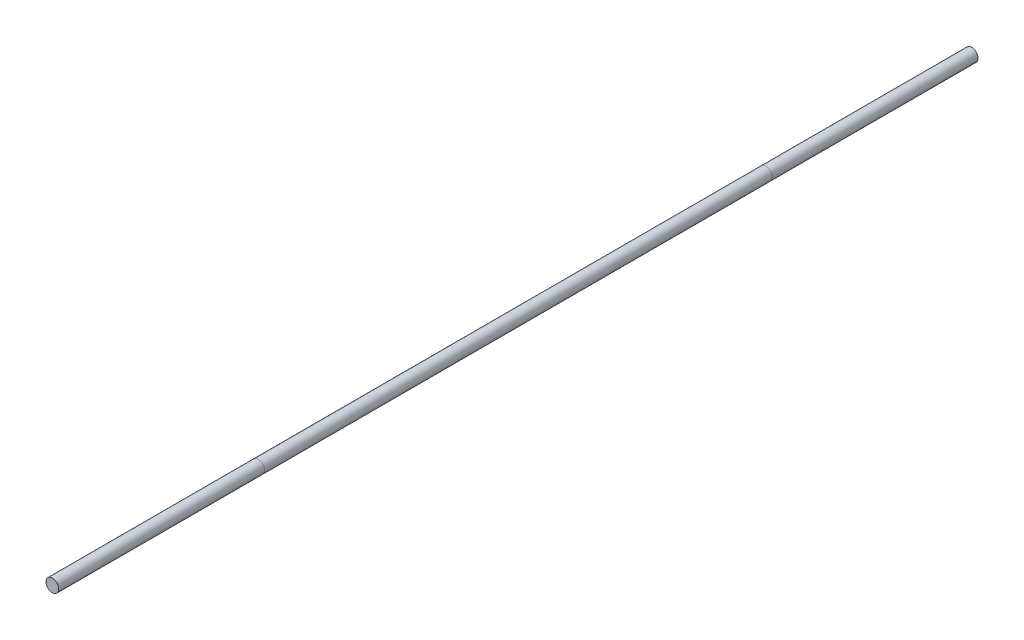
ISO-10303-21;
HEADER;
FILE_DESCRIPTION(('STEP AP214'),'2;1');
FILE_NAME('part.step','',(''),(''),'','','');
FILE_SCHEMA(('AUTOMOTIVE_DESIGN { 1 0 10303 214 1 1 1 1 }'));
ENDSEC;
DATA;
#1=APPLICATION_CONTEXT('core data for automotive mechanical design processes');
#2=APPLICATION_PROTOCOL_DEFINITION('international standard','automotive_design',2000,#1);
#3=PRODUCT_CONTEXT('',#1,'mechanical');
#4=PRODUCT('Part','Part','',(#3));
#5=PRODUCT_RELATED_PRODUCT_CATEGORY('part','',(#4));
#6=PRODUCT_DEFINITION_FORMATION('','',#4);
#7=PRODUCT_DEFINITION_CONTEXT('part definition',#1,'design');
#8=PRODUCT_DEFINITION('design','',#6,#7);
#9=PRODUCT_DEFINITION_SHAPE('','',#8);
#10=(LENGTH_UNIT() NAMED_UNIT(*) SI_UNIT(.MILLI.,.METRE.));
#11=(NAMED_UNIT(*) PLANE_ANGLE_UNIT() SI_UNIT($,.RADIAN.));
#12=(NAMED_UNIT(*) SI_UNIT($,.STERADIAN.) SOLID_ANGLE_UNIT());
#13=UNCERTAINTY_MEASURE_WITH_UNIT(LENGTH_MEASURE(1.E-05),#10,'distance_accuracy_value','');
#14=(GEOMETRIC_REPRESENTATION_CONTEXT(3) GLOBAL_UNCERTAINTY_ASSIGNED_CONTEXT((#13)) GLOBAL_UNIT_ASSIGNED_CONTEXT((#10,
#11,#12)) REPRESENTATION_CONTEXT('',''));
#15=CARTESIAN_POINT('',(0.,0.,0.));
#16=DIRECTION('',(0.,0.,1.));
#17=DIRECTION('',(1.,0.,0.));
#18=AXIS2_PLACEMENT_3D('',#15,#16,#17);
#19=CARTESIAN_POINT('',(0.,0.,230.));
#20=DIRECTION('',(0.,0.,-1.));
#21=DIRECTION('',(-1.,0.,0.));
#22=AXIS2_PLACEMENT_3D('',#19,#20,#21);
#23=CYLINDRICAL_SURFACE('',#22,3.175);
#24=CARTESIAN_POINT('',(0.,0.,127.));
#25=DIRECTION('',(0.,0.,1.));
#26=DIRECTION('',(1.,0.,0.));
#27=AXIS2_PLACEMENT_3D('',#24,#25,#26);
#28=CIRCLE('',#27,3.175);
#29=CARTESIAN_POINT('',(3.175,0.,127.));
#30=VERTEX_POINT('',#29);
#31=EDGE_CURVE('E42',#30,#30,#28,.T.);
#32=ORIENTED_EDGE('',*,*,#31,.F.);
#33=EDGE_LOOP('',(#32));
#34=FACE_BOUND('',#33,.T.);
#35=CARTESIAN_POINT('',(0.,0.,-127.));
#36=DIRECTION('',(0.,0.,1.));
#37=DIRECTION('',(1.,0.,0.));
#38=AXIS2_PLACEMENT_3D('',#35,#36,#37);
#39=CIRCLE('',#38,3.175);
#40=CARTESIAN_POINT('',(3.175,0.,-127.));
#41=VERTEX_POINT('',#40);
#42=EDGE_CURVE('E11',#41,#41,#39,.T.);
#43=ORIENTED_EDGE('',*,*,#42,.T.);
#44=EDGE_LOOP('',(#43));
#45=FACE_BOUND('',#44,.T.);
#46=ADVANCED_FACE('F35',(#34,#45),#23,.T.);
#47=CARTESIAN_POINT('',(0.,0.,230.));
#48=DIRECTION('',(0.,0.,1.));
#49=DIRECTION('',(1.,0.,0.));
#50=AXIS2_PLACEMENT_3D('',#47,#48,#49);
#51=CIRCLE('',#50,3.175);
#52=CARTESIAN_POINT('',(3.175,0.,230.));
#53=VERTEX_POINT('',#52);
#54=EDGE_CURVE('E46',#53,#53,#51,.T.);
#55=ORIENTED_EDGE('',*,*,#54,.F.);
#56=EDGE_LOOP('',(#55));
#57=FACE_BOUND('',#56,.T.);
#58=ORIENTED_EDGE('',*,*,#31,.T.);
#59=EDGE_LOOP('',(#58));
#60=FACE_BOUND('',#59,.T.);
#61=ADVANCED_FACE('F66',(#57,#60),#23,.T.);
#62=ORIENTED_EDGE('',*,*,#42,.F.);
#63=EDGE_LOOP('',(#62));
#64=FACE_BOUND('',#63,.T.);
#65=CARTESIAN_POINT('',(0.,0.,-230.));
#66=DIRECTION('',(0.,0.,1.));
#67=DIRECTION('',(1.,0.,0.));
#68=AXIS2_PLACEMENT_3D('',#65,#66,#67);
#69=CIRCLE('',#68,3.175);
#70=CARTESIAN_POINT('',(3.175,0.,-230.));
#71=VERTEX_POINT('',#70);
#72=EDGE_CURVE('E50',#71,#71,#69,.T.);
#73=ORIENTED_EDGE('',*,*,#72,.T.);
#74=EDGE_LOOP('',(#73));
#75=FACE_BOUND('',#74,.T.);
#76=ADVANCED_FACE('F37',(#64,#75),#23,.T.);
#77=CARTESIAN_POINT('',(0.,0.,230.));
#78=DIRECTION('',(0.,0.,1.));
#79=DIRECTION('',(1.,0.,0.));
#80=AXIS2_PLACEMENT_3D('',#77,#78,#79);
#81=PLANE('',#80);
#82=ORIENTED_EDGE('',*,*,#54,.T.);
#83=EDGE_LOOP('',(#82));
#84=FACE_BOUND('',#83,.T.);
#85=ADVANCED_FACE('F59',(#84),#81,.T.);
#86=CARTESIAN_POINT('',(0.,0.,-230.));
#87=DIRECTION('',(0.,0.,1.));
#88=DIRECTION('',(1.,0.,0.));
#89=AXIS2_PLACEMENT_3D('',#86,#87,#88);
#90=PLANE('',#89);
#91=ORIENTED_EDGE('',*,*,#72,.F.);
#92=EDGE_LOOP('',(#91));
#93=FACE_BOUND('',#92,.T.);
#94=ADVANCED_FACE('F57',(#93),#90,.F.);
#95=CLOSED_SHELL('',(#46,#61,#76,#85,#94));
#96=MANIFOLD_SOLID_BREP('B2',#95);
#97=ADVANCED_BREP_SHAPE_REPRESENTATION('',(#18,#96),#14);
#98=SHAPE_DEFINITION_REPRESENTATION(#9,#97);
ENDSEC;
END-ISO-10303-21;
